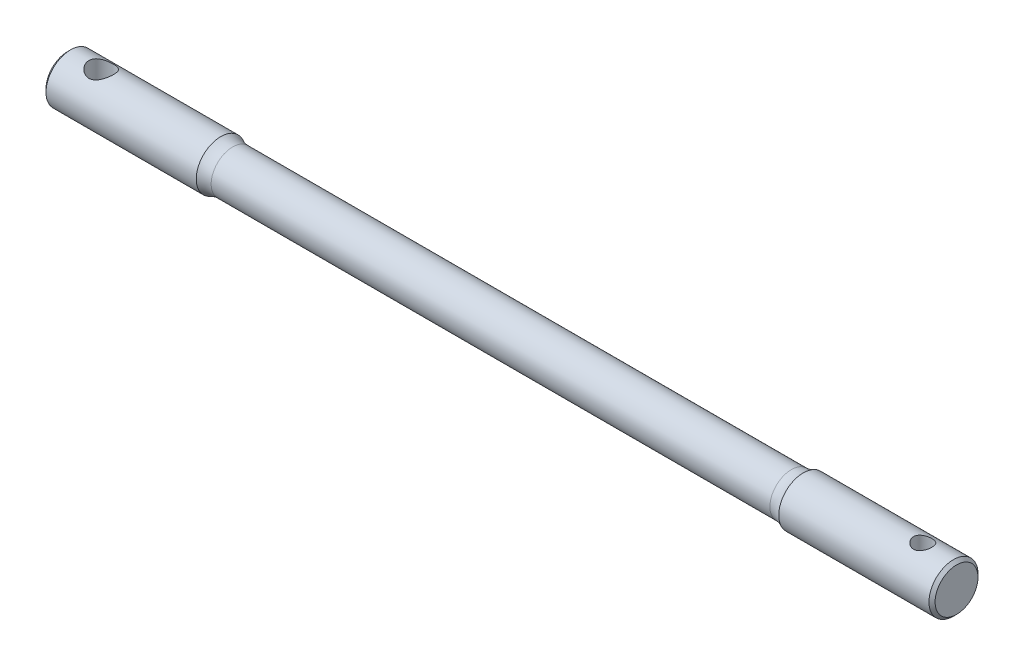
ISO-10303-21;
HEADER;
FILE_DESCRIPTION(('STEP AP214'),'2;1');
FILE_NAME('part.step','',(''),(''),'','','');
FILE_SCHEMA(('AUTOMOTIVE_DESIGN { 1 0 10303 214 1 1 1 1 }'));
ENDSEC;
DATA;
#1=APPLICATION_CONTEXT('core data for automotive mechanical design processes');
#2=APPLICATION_PROTOCOL_DEFINITION('international standard','automotive_design',2000,#1);
#3=PRODUCT_CONTEXT('',#1,'mechanical');
#4=PRODUCT('Part','Part','',(#3));
#5=PRODUCT_RELATED_PRODUCT_CATEGORY('part','',(#4));
#6=PRODUCT_DEFINITION_FORMATION('','',#4);
#7=PRODUCT_DEFINITION_CONTEXT('part definition',#1,'design');
#8=PRODUCT_DEFINITION('design','',#6,#7);
#9=PRODUCT_DEFINITION_SHAPE('','',#8);
#10=(LENGTH_UNIT() NAMED_UNIT(*) SI_UNIT(.MILLI.,.METRE.));
#11=(NAMED_UNIT(*) PLANE_ANGLE_UNIT() SI_UNIT($,.RADIAN.));
#12=(NAMED_UNIT(*) SI_UNIT($,.STERADIAN.) SOLID_ANGLE_UNIT());
#13=UNCERTAINTY_MEASURE_WITH_UNIT(LENGTH_MEASURE(1.E-05),#10,'distance_accuracy_value','');
#14=(GEOMETRIC_REPRESENTATION_CONTEXT(3) GLOBAL_UNCERTAINTY_ASSIGNED_CONTEXT((#13)) GLOBAL_UNIT_ASSIGNED_CONTEXT((#10,
#11,#12)) REPRESENTATION_CONTEXT('',''));
#15=CARTESIAN_POINT('',(0.,0.,0.));
#16=DIRECTION('',(0.,0.,1.));
#17=DIRECTION('',(1.,0.,0.));
#18=AXIS2_PLACEMENT_3D('',#15,#16,#17);
#19=CARTESIAN_POINT('',(0.,0.,0.));
#20=DIRECTION('',(1.,0.,0.));
#21=DIRECTION('',(0.,0.,-1.));
#22=AXIS2_PLACEMENT_3D('',#19,#20,#21);
#23=PLANE('',#22);
#24=CARTESIAN_POINT('',(0.,0.,0.));
#25=DIRECTION('',(1.,0.,0.));
#26=DIRECTION('',(0.,0.,-1.));
#27=AXIS2_PLACEMENT_3D('',#24,#25,#26);
#28=CIRCLE('',#27,3.49999999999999);
#29=CARTESIAN_POINT('',(0.,0.,-3.49999999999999));
#30=VERTEX_POINT('',#29);
#31=EDGE_CURVE('E35',#30,#30,#28,.T.);
#32=ORIENTED_EDGE('',*,*,#31,.T.);
#33=EDGE_LOOP('',(#32));
#34=FACE_BOUND('',#33,.T.);
#35=ADVANCED_FACE('F29',(#34),#23,.T.);
#36=CARTESIAN_POINT('',(36.,0.,0.));
#37=DIRECTION('',(1.,0.,0.));
#38=DIRECTION('',(0.,0.,-1.));
#39=AXIS2_PLACEMENT_3D('',#36,#37,#38);
#40=CYLINDRICAL_SURFACE('',#39,4.);
#41=CARTESIAN_POINT('',(-0.5,0.,0.));
#42=DIRECTION('',(1.,0.,0.));
#43=DIRECTION('',(0.,0.,-1.));
#44=AXIS2_PLACEMENT_3D('',#41,#42,#43);
#45=CIRCLE('',#44,4.);
#46=CARTESIAN_POINT('',(-0.5,0.,-4.));
#47=VERTEX_POINT('',#46);
#48=EDGE_CURVE('E10',#47,#47,#45,.F.);
#49=ORIENTED_EDGE('',*,*,#48,.T.);
#50=EDGE_LOOP('',(#49));
#51=FACE_BOUND('',#50,.T.);
#52=CARTESIAN_POINT('',(-5.5,3.70809924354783,1.5));
#53=CARTESIAN_POINT('',(-5.41899251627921,3.70809640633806,1.50000304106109));
#54=CARTESIAN_POINT('',(-5.33800507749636,3.71078260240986,1.49341597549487));
#55=CARTESIAN_POINT('',(-5.1784719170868,3.72116159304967,1.46736187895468));
#56=CARTESIAN_POINT('',(-5.09992612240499,3.72885423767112,1.44789523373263));
#57=CARTESIAN_POINT('',(-4.94762462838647,3.748254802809,1.39689657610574));
#58=CARTESIAN_POINT('',(-4.87385794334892,3.7599530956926,1.36539347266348));
#59=CARTESIAN_POINT('',(-4.73262810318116,3.78603134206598,1.29131856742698));
#60=CARTESIAN_POINT('',(-4.66516684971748,3.80041210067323,1.24874344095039));
#61=CARTESIAN_POINT('',(-4.53510968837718,3.83103574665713,1.15146661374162));
#62=CARTESIAN_POINT('',(-4.47287147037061,3.84733341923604,1.09630381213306));
#63=CARTESIAN_POINT('',(-4.35827718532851,3.87949750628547,0.976395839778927));
#64=CARTESIAN_POINT('',(-4.30592322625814,3.89536382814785,0.91164863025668));
#65=CARTESIAN_POINT('',(-4.21086048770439,3.92552873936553,0.771694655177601));
#66=CARTESIAN_POINT('',(-4.16854052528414,3.93975561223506,0.696206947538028));
#67=CARTESIAN_POINT('',(-4.09734882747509,3.96438007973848,0.538555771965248));
#68=CARTESIAN_POINT('',(-4.06847242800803,3.97477900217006,0.456394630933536));
#69=CARTESIAN_POINT('',(-4.02624210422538,3.9901869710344,0.291489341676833));
#70=CARTESIAN_POINT('',(-4.01227237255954,3.99540915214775,0.208923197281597));
#71=CARTESIAN_POINT('',(-3.99827879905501,4.0006401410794,0.0424643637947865));
#72=CARTESIAN_POINT('',(-3.99825042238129,4.00065064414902,-0.0414278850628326));
#73=CARTESIAN_POINT('',(-4.01178176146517,3.99559265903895,-0.203743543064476));
#74=CARTESIAN_POINT('',(-4.02466929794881,3.99077541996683,-0.2822321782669));
#75=CARTESIAN_POINT('',(-4.06253591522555,3.97693274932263,-0.435839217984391));
#76=CARTESIAN_POINT('',(-4.08751585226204,3.96790701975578,-0.510957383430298));
#77=CARTESIAN_POINT('',(-4.14917045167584,3.94637769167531,-0.656989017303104));
#78=CARTESIAN_POINT('',(-4.18601000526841,3.93382539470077,-0.727825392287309));
#79=CARTESIAN_POINT('',(-4.27019209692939,3.90651310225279,-0.862486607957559));
#80=CARTESIAN_POINT('',(-4.3175380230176,3.8917523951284,-0.926309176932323));
#81=CARTESIAN_POINT('',(-4.42462728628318,3.86052529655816,-1.04909048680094));
#82=CARTESIAN_POINT('',(-4.48493391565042,3.84400963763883,-1.10754614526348));
#83=CARTESIAN_POINT('',(-4.61459299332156,3.81182460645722,-1.21370395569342));
#84=CARTESIAN_POINT('',(-4.68394770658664,3.79615544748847,-1.261403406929));
#85=CARTESIAN_POINT('',(-4.83171946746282,3.76712703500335,-1.34565611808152));
#86=CARTESIAN_POINT('',(-4.91030349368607,3.75382677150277,-1.38193847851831));
#87=CARTESIAN_POINT('',(-5.07309622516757,3.73172438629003,-1.44056464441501));
#88=CARTESIAN_POINT('',(-5.15730177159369,3.72291976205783,-1.46291620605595));
#89=CARTESIAN_POINT('',(-5.32397596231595,3.71139597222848,-1.49190191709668));
#90=CARTESIAN_POINT('',(-5.40628410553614,3.70836785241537,-1.49933521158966));
#91=CARTESIAN_POINT('',(-5.57100935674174,3.70786539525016,-1.50057885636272));
#92=CARTESIAN_POINT('',(-5.65342643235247,3.71038967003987,-1.49439261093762));
#93=CARTESIAN_POINT('',(-5.81192992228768,3.72039381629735,-1.46929733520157));
#94=CARTESIAN_POINT('',(-5.88813113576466,3.72763276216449,-1.45100618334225));
#95=CARTESIAN_POINT('',(-6.03634794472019,3.74596487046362,-1.40299774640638));
#96=CARTESIAN_POINT('',(-6.10836267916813,3.75705882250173,-1.37327812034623));
#97=CARTESIAN_POINT('',(-6.24916443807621,3.7823624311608,-1.30200292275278));
#98=CARTESIAN_POINT('',(-6.31772929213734,3.79667328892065,-1.26004545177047));
#99=CARTESIAN_POINT('',(-6.44712898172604,3.82662814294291,-1.16591317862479));
#100=CARTESIAN_POINT('',(-6.50796097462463,3.84227262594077,-1.11373463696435));
#101=CARTESIAN_POINT('',(-6.6241683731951,3.87433046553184,-0.996727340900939));
#102=CARTESIAN_POINT('',(-6.67895340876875,3.89072969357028,-0.931306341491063));
#103=CARTESIAN_POINT('',(-6.77683836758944,3.92149874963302,-0.791797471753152));
#104=CARTESIAN_POINT('',(-6.81993825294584,3.93586857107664,-0.717709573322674));
#105=CARTESIAN_POINT('',(-6.89294605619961,3.96094985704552,-0.563016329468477));
#106=CARTESIAN_POINT('',(-6.9228991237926,3.9716738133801,-0.482434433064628));
#107=CARTESIAN_POINT('',(-6.96865641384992,3.98829436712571,-0.316881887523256));
#108=CARTESIAN_POINT('',(-6.9844672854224,3.99419323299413,-0.231913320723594));
#109=CARTESIAN_POINT('',(-7.00077440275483,4.00028407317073,-0.0653355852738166));
#110=CARTESIAN_POINT('',(-7.00210948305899,4.00078860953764,0.0161807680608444));
#111=CARTESIAN_POINT('',(-6.99158484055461,3.99684889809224,0.178226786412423));
#112=CARTESIAN_POINT('',(-6.97972670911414,3.9924052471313,0.258756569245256));
#113=CARTESIAN_POINT('',(-6.94374114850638,3.97921089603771,0.414548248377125));
#114=CARTESIAN_POINT('',(-6.91992009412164,3.97056791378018,0.489890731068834));
#115=CARTESIAN_POINT('',(-6.86098998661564,3.9498778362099,0.635515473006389));
#116=CARTESIAN_POINT('',(-6.82587879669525,3.93783009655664,0.705796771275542));
#117=CARTESIAN_POINT('',(-6.74368605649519,3.91090618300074,0.842540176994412));
#118=CARTESIAN_POINT('',(-6.69616335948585,3.89593240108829,0.908717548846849));
#119=CARTESIAN_POINT('',(-6.5911921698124,3.86499507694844,1.03241734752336));
#120=CARTESIAN_POINT('',(-6.53374013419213,3.84903118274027,1.0899366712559));
#121=CARTESIAN_POINT('',(-6.40693586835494,3.81688129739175,1.19781214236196));
#122=CARTESIAN_POINT('',(-6.33711559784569,3.8007280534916,1.24762999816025));
#123=CARTESIAN_POINT('',(-6.18958413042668,3.77098325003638,1.33484709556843));
#124=CARTESIAN_POINT('',(-6.11187211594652,3.75739195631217,1.37224504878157));
#125=CARTESIAN_POINT('',(-5.9470443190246,3.73402269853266,1.4346588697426));
#126=CARTESIAN_POINT('',(-5.85966563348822,3.7244380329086,1.45906002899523));
#127=CARTESIAN_POINT('',(-5.68151472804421,3.71147994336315,1.49172356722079));
#128=CARTESIAN_POINT('',(-5.59074478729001,3.70810242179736,1.49999659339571));
#129=CARTESIAN_POINT('',(-5.5,3.70809924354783,1.5));
#130=B_SPLINE_CURVE_WITH_KNOTS('',3,(#52,#53,#54,#55,#56,#57,#58,#59,#60,#61,#62,#63,#64,#65,
#66,#67,#68,#69,#70,#71,#72,#73,#74,#75,#76,#77,#78,#79,#80,#81,#82,#83,#84,#85,#86,#87,#88,#89,
#90,#91,#92,#93,#94,#95,#96,#97,#98,#99,#100,#101,#102,#103,#104,#105,#106,#107,#108,#109,#110,
#111,#112,#113,#114,#115,#116,#117,#118,#119,#120,#121,#122,#123,#124,#125,#126,#127,#128,#129),
.UNSPECIFIED.,.T.,.F.,(4,2,2,2,2,2,2,2,2,2,2,2,2,2,2,2,2,2,2,2,2,2,2,2,2,2,2,2,2,2,2,2,2,2,2,2,
2,2,4),(0.,0.242684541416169,0.485361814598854,0.727459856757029,0.969630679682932,
1.22274652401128,1.47591628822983,1.73770072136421,1.9993942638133,2.24980018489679,
2.50012465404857,2.73806472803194,2.97602165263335,3.21744131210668,3.45893893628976,
3.71456675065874,3.97025867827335,4.23162592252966,4.49284751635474,4.73965657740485,
4.98640395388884,5.22143845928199,5.45652113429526,5.70041561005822,5.94439948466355,
6.20385016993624,6.46330169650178,6.72185508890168,6.98028685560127,7.22365720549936,
7.4669982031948,7.70440274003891,7.94185223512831,8.18928323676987,8.43680270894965,
8.69738599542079,8.95799630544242,9.23003178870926,9.50188762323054),.UNSPECIFIED.);
#131=CARTESIAN_POINT('',(-5.5,3.70809924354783,1.5));
#132=VERTEX_POINT('',#131);
#133=EDGE_CURVE('E56',#132,#132,#130,.T.);
#134=ORIENTED_EDGE('',*,*,#133,.F.);
#135=EDGE_LOOP('',(#134));
#136=FACE_BOUND('',#135,.T.);
#137=CARTESIAN_POINT('',(-5.5,-3.70809924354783,1.5));
#138=CARTESIAN_POINT('',(-5.58100748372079,-3.70809640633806,1.50000304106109));
#139=CARTESIAN_POINT('',(-5.66199492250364,-3.71078260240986,1.49341597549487));
#140=CARTESIAN_POINT('',(-5.8215280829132,-3.72116159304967,1.46736187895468));
#141=CARTESIAN_POINT('',(-5.90007387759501,-3.72885423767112,1.44789523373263));
#142=CARTESIAN_POINT('',(-6.05237537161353,-3.748254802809,1.39689657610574));
#143=CARTESIAN_POINT('',(-6.12614205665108,-3.7599530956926,1.36539347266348));
#144=CARTESIAN_POINT('',(-6.26737189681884,-3.78603134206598,1.29131856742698));
#145=CARTESIAN_POINT('',(-6.33483315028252,-3.80041210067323,1.24874344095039));
#146=CARTESIAN_POINT('',(-6.46489031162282,-3.83103574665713,1.15146661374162));
#147=CARTESIAN_POINT('',(-6.52712852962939,-3.84733341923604,1.09630381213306));
#148=CARTESIAN_POINT('',(-6.64172281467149,-3.87949750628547,0.976395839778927));
#149=CARTESIAN_POINT('',(-6.69407677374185,-3.89536382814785,0.91164863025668));
#150=CARTESIAN_POINT('',(-6.78913951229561,-3.92552873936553,0.771694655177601));
#151=CARTESIAN_POINT('',(-6.83145947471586,-3.93975561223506,0.696206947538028));
#152=CARTESIAN_POINT('',(-6.90265117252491,-3.96438007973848,0.538555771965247));
#153=CARTESIAN_POINT('',(-6.93152757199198,-3.97477900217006,0.456394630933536));
#154=CARTESIAN_POINT('',(-6.97375789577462,-3.9901869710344,0.291489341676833));
#155=CARTESIAN_POINT('',(-6.98772762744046,-3.99540915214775,0.208923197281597));
#156=CARTESIAN_POINT('',(-7.00172120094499,-4.0006401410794,0.0424643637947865));
#157=CARTESIAN_POINT('',(-7.00174957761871,-4.00065064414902,-0.0414278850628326));
#158=CARTESIAN_POINT('',(-6.98821823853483,-3.99559265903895,-0.203743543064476));
#159=CARTESIAN_POINT('',(-6.97533070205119,-3.99077541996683,-0.2822321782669));
#160=CARTESIAN_POINT('',(-6.93746408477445,-3.97693274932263,-0.435839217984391));
#161=CARTESIAN_POINT('',(-6.91248414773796,-3.96790701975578,-0.510957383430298));
#162=CARTESIAN_POINT('',(-6.85082954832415,-3.94637769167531,-0.656989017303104));
#163=CARTESIAN_POINT('',(-6.81398999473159,-3.93382539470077,-0.727825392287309));
#164=CARTESIAN_POINT('',(-6.72980790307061,-3.90651310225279,-0.862486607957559));
#165=CARTESIAN_POINT('',(-6.6824619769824,-3.8917523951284,-0.926309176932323));
#166=CARTESIAN_POINT('',(-6.57537271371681,-3.86052529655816,-1.04909048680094));
#167=CARTESIAN_POINT('',(-6.51506608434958,-3.84400963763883,-1.10754614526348));
#168=CARTESIAN_POINT('',(-6.38540700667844,-3.81182460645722,-1.21370395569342));
#169=CARTESIAN_POINT('',(-6.31605229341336,-3.79615544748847,-1.261403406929));
#170=CARTESIAN_POINT('',(-6.16828053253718,-3.76712703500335,-1.34565611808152));
#171=CARTESIAN_POINT('',(-6.08969650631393,-3.75382677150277,-1.38193847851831));
#172=CARTESIAN_POINT('',(-5.92690377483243,-3.73172438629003,-1.44056464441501));
#173=CARTESIAN_POINT('',(-5.84269822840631,-3.72291976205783,-1.46291620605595));
#174=CARTESIAN_POINT('',(-5.67602403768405,-3.71139597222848,-1.49190191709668));
#175=CARTESIAN_POINT('',(-5.59371589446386,-3.70836785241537,-1.49933521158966));
#176=CARTESIAN_POINT('',(-5.42899064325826,-3.70786539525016,-1.50057885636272));
#177=CARTESIAN_POINT('',(-5.34657356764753,-3.71038967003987,-1.49439261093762));
#178=CARTESIAN_POINT('',(-5.18807007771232,-3.72039381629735,-1.46929733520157));
#179=CARTESIAN_POINT('',(-5.11186886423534,-3.72763276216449,-1.45100618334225));
#180=CARTESIAN_POINT('',(-4.96365205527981,-3.74596487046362,-1.40299774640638));
#181=CARTESIAN_POINT('',(-4.89163732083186,-3.75705882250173,-1.37327812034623));
#182=CARTESIAN_POINT('',(-4.75083556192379,-3.7823624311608,-1.30200292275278));
#183=CARTESIAN_POINT('',(-4.68227070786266,-3.79667328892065,-1.26004545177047));
#184=CARTESIAN_POINT('',(-4.55287101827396,-3.82662814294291,-1.16591317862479));
#185=CARTESIAN_POINT('',(-4.49203902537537,-3.84227262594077,-1.11373463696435));
#186=CARTESIAN_POINT('',(-4.3758316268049,-3.87433046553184,-0.996727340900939));
#187=CARTESIAN_POINT('',(-4.32104659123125,-3.89072969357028,-0.931306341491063));
#188=CARTESIAN_POINT('',(-4.22316163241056,-3.92149874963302,-0.791797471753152));
#189=CARTESIAN_POINT('',(-4.18006174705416,-3.93586857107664,-0.717709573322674));
#190=CARTESIAN_POINT('',(-4.10705394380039,-3.96094985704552,-0.563016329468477));
#191=CARTESIAN_POINT('',(-4.0771008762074,-3.9716738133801,-0.482434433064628));
#192=CARTESIAN_POINT('',(-4.03134358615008,-3.98829436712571,-0.316881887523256));
#193=CARTESIAN_POINT('',(-4.0155327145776,-3.99419323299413,-0.231913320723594));
#194=CARTESIAN_POINT('',(-3.99922559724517,-4.00028407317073,-0.0653355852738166));
#195=CARTESIAN_POINT('',(-3.99789051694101,-4.00078860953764,0.0161807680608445));
#196=CARTESIAN_POINT('',(-4.00841515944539,-3.99684889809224,0.178226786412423));
#197=CARTESIAN_POINT('',(-4.02027329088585,-3.9924052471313,0.258756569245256));
#198=CARTESIAN_POINT('',(-4.05625885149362,-3.97921089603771,0.414548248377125));
#199=CARTESIAN_POINT('',(-4.08007990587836,-3.97056791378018,0.489890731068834));
#200=CARTESIAN_POINT('',(-4.13901001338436,-3.9498778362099,0.635515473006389));
#201=CARTESIAN_POINT('',(-4.17412120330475,-3.93783009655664,0.705796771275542));
#202=CARTESIAN_POINT('',(-4.25631394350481,-3.91090618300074,0.842540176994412));
#203=CARTESIAN_POINT('',(-4.30383664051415,-3.89593240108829,0.908717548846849));
#204=CARTESIAN_POINT('',(-4.4088078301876,-3.86499507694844,1.03241734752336));
#205=CARTESIAN_POINT('',(-4.46625986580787,-3.84903118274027,1.0899366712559));
#206=CARTESIAN_POINT('',(-4.59306413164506,-3.81688129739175,1.19781214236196));
#207=CARTESIAN_POINT('',(-4.66288440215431,-3.8007280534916,1.24762999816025));
#208=CARTESIAN_POINT('',(-4.81041586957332,-3.77098325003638,1.33484709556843));
#209=CARTESIAN_POINT('',(-4.88812788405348,-3.75739195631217,1.37224504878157));
#210=CARTESIAN_POINT('',(-5.0529556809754,-3.73402269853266,1.4346588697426));
#211=CARTESIAN_POINT('',(-5.14033436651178,-3.7244380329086,1.45906002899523));
#212=CARTESIAN_POINT('',(-5.31848527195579,-3.71147994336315,1.49172356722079));
#213=CARTESIAN_POINT('',(-5.40925521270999,-3.70810242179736,1.49999659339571));
#214=CARTESIAN_POINT('',(-5.5,-3.70809924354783,1.5));
#215=B_SPLINE_CURVE_WITH_KNOTS('',3,(#137,#138,#139,#140,#141,#142,#143,#144,#145,#146,#147,
#148,#149,#150,#151,#152,#153,#154,#155,#156,#157,#158,#159,#160,#161,#162,#163,#164,#165,#166,
#167,#168,#169,#170,#171,#172,#173,#174,#175,#176,#177,#178,#179,#180,#181,#182,#183,#184,#185,
#186,#187,#188,#189,#190,#191,#192,#193,#194,#195,#196,#197,#198,#199,#200,#201,#202,#203,#204,
#205,#206,#207,#208,#209,#210,#211,#212,#213,#214),.UNSPECIFIED.,.T.,.F.,(4,2,2,2,2,2,2,2,2,2,2,
2,2,2,2,2,2,2,2,2,2,2,2,2,2,2,2,2,2,2,2,2,2,2,2,2,2,2,4),(0.,0.242684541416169,
0.485361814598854,0.727459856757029,0.969630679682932,1.22274652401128,1.47591628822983,
1.73770072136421,1.9993942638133,2.24980018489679,2.50012465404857,2.73806472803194,
2.97602165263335,3.21744131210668,3.45893893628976,3.71456675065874,3.97025867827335,
4.23162592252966,4.49284751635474,4.73965657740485,4.98640395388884,5.22143845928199,
5.45652113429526,5.70041561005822,5.94439948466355,6.20385016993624,6.46330169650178,
6.72185508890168,6.98028685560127,7.22365720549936,7.4669982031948,7.70440274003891,
7.94185223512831,8.18928323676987,8.43680270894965,8.69738599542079,8.95799630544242,
9.23003178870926,9.50188762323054),.UNSPECIFIED.);
#216=CARTESIAN_POINT('',(-5.5,-3.70809924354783,1.5));
#217=VERTEX_POINT('',#216);
#218=EDGE_CURVE('E80',#217,#217,#215,.T.);
#219=ORIENTED_EDGE('',*,*,#218,.F.);
#220=EDGE_LOOP('',(#219));
#221=FACE_BOUND('',#220,.T.);
#222=CARTESIAN_POINT('',(-25.,0.,0.));
#223=DIRECTION('',(1.,0.,0.));
#224=DIRECTION('',(0.,0.,-1.));
#225=AXIS2_PLACEMENT_3D('',#222,#223,#224);
#226=CIRCLE('',#225,4.);
#227=CARTESIAN_POINT('',(-25.,0.,-4.));
#228=VERTEX_POINT('',#227);
#229=EDGE_CURVE('E194',#228,#228,#226,.T.);
#230=ORIENTED_EDGE('',*,*,#229,.T.);
#231=EDGE_LOOP('',(#230));
#232=FACE_BOUND('',#231,.T.);
#233=ADVANCED_FACE('F88',(#51,#136,#221,#232),#40,.T.);
#234=CARTESIAN_POINT('',(-26.9364916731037,0.,0.));
#235=DIRECTION('',(1.,0.,0.));
#236=DIRECTION('',(0.,0.,-1.));
#237=AXIS2_PLACEMENT_3D('',#234,#235,#236);
#238=TOROIDAL_SURFACE('',#237,7.5,4.);
#239=ORIENTED_EDGE('',*,*,#229,.F.);
#240=EDGE_LOOP('',(#239));
#241=FACE_BOUND('',#240,.T.);
#242=CARTESIAN_POINT('',(-26.9364916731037,0.,0.));
#243=DIRECTION('',(1.,0.,0.));
#244=DIRECTION('',(0.,0.,-1.));
#245=AXIS2_PLACEMENT_3D('',#242,#243,#244);
#246=CIRCLE('',#245,3.5);
#247=CARTESIAN_POINT('',(-26.9364916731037,0.,-3.5));
#248=VERTEX_POINT('',#247);
#249=EDGE_CURVE('E190',#248,#248,#246,.T.);
#250=ORIENTED_EDGE('',*,*,#249,.T.);
#251=EDGE_LOOP('',(#250));
#252=FACE_BOUND('',#251,.T.);
#253=ADVANCED_FACE('F92',(#241,#252),#238,.F.);
#254=CARTESIAN_POINT('',(36.,0.,0.));
#255=DIRECTION('',(1.,0.,0.));
#256=DIRECTION('',(0.,0.,-1.));
#257=AXIS2_PLACEMENT_3D('',#254,#255,#256);
#258=CYLINDRICAL_SURFACE('',#257,3.50000000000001);
#259=CARTESIAN_POINT('',(-118.063508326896,0.,0.));
#260=DIRECTION('',(1.,0.,0.));
#261=DIRECTION('',(0.,0.,-1.));
#262=AXIS2_PLACEMENT_3D('',#259,#260,#261);
#263=CIRCLE('',#262,3.50000000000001);
#264=CARTESIAN_POINT('',(-118.063508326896,0.,-3.50000000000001));
#265=VERTEX_POINT('',#264);
#266=EDGE_CURVE('E187',#265,#265,#263,.T.);
#267=ORIENTED_EDGE('',*,*,#266,.T.);
#268=EDGE_LOOP('',(#267));
#269=FACE_BOUND('',#268,.T.);
#270=ORIENTED_EDGE('',*,*,#249,.F.);
#271=EDGE_LOOP('',(#270));
#272=FACE_BOUND('',#271,.T.);
#273=ADVANCED_FACE('F96',(#269,#272),#258,.T.);
#274=CARTESIAN_POINT('',(-118.063508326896,0.,0.));
#275=DIRECTION('',(1.,0.,0.));
#276=DIRECTION('',(0.,0.,-1.));
#277=AXIS2_PLACEMENT_3D('',#274,#275,#276);
#278=TOROIDAL_SURFACE('',#277,7.50000000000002,4.);
#279=ORIENTED_EDGE('',*,*,#266,.F.);
#280=EDGE_LOOP('',(#279));
#281=FACE_BOUND('',#280,.T.);
#282=CARTESIAN_POINT('',(-120.,0.,0.));
#283=DIRECTION('',(1.,0.,0.));
#284=DIRECTION('',(0.,0.,-1.));
#285=AXIS2_PLACEMENT_3D('',#282,#283,#284);
#286=CIRCLE('',#285,4.00000000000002);
#287=CARTESIAN_POINT('',(-120.,0.,-4.00000000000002));
#288=VERTEX_POINT('',#287);
#289=EDGE_CURVE('E87',#288,#288,#286,.T.);
#290=ORIENTED_EDGE('',*,*,#289,.T.);
#291=EDGE_LOOP('',(#290));
#292=FACE_BOUND('',#291,.T.);
#293=ADVANCED_FACE('F99',(#281,#292),#278,.F.);
#294=CARTESIAN_POINT('',(36.,0.,0.));
#295=DIRECTION('',(1.,0.,0.));
#296=DIRECTION('',(0.,0.,-1.));
#297=AXIS2_PLACEMENT_3D('',#294,#295,#296);
#298=CYLINDRICAL_SURFACE('',#297,4.00000000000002);
#299=CARTESIAN_POINT('',(-144.5,0.,0.));
#300=DIRECTION('',(-1.,0.,0.));
#301=DIRECTION('',(0.,0.,1.));
#302=AXIS2_PLACEMENT_3D('',#299,#300,#301);
#303=CIRCLE('',#302,4.00000000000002);
#304=CARTESIAN_POINT('',(-144.5,0.,4.00000000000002));
#305=VERTEX_POINT('',#304);
#306=EDGE_CURVE('E43',#305,#305,#303,.F.);
#307=ORIENTED_EDGE('',*,*,#306,.T.);
#308=EDGE_LOOP('',(#307));
#309=FACE_BOUND('',#308,.T.);
#310=CARTESIAN_POINT('',(-139.5,3.46410161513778,2.));
#311=CARTESIAN_POINT('',(-139.395786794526,3.4641118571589,1.99999158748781));
#312=CARTESIAN_POINT('',(-139.291437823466,3.4688763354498,1.99179963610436));
#313=CARTESIAN_POINT('',(-139.085944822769,3.48724701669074,1.95944672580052));
#314=CARTESIAN_POINT('',(-138.984807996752,3.50087179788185,1.93525221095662));
#315=CARTESIAN_POINT('',(-138.789096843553,3.53498701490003,1.8721998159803));
#316=CARTESIAN_POINT('',(-138.694490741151,3.5554408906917,1.83341988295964));
#317=CARTESIAN_POINT('',(-138.513151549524,3.60085327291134,1.74253507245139));
#318=CARTESIAN_POINT('',(-138.426418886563,3.62581202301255,1.69042947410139));
#319=CARTESIAN_POINT('',(-138.255388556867,3.67993738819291,1.56933307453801));
#320=CARTESIAN_POINT('',(-138.171881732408,3.70928127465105,1.49930407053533));
#321=CARTESIAN_POINT('',(-138.017183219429,3.76743965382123,1.34650761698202));
#322=CARTESIAN_POINT('',(-137.945997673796,3.7962538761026,1.26373385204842));
#323=CARTESIAN_POINT('',(-137.813265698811,3.85242953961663,1.08097912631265));
#324=CARTESIAN_POINT('',(-137.752692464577,3.87956212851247,0.980214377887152));
#325=CARTESIAN_POINT('',(-137.649718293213,3.92701512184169,0.768314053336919));
#326=CARTESIAN_POINT('',(-137.607305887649,3.94733982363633,0.657185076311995));
#327=CARTESIAN_POINT('',(-137.544990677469,3.97760922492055,0.436089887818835));
#328=CARTESIAN_POINT('',(-137.523700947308,3.98818960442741,0.326603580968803));
#329=CARTESIAN_POINT('',(-137.499667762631,4.00015167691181,0.105141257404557));
#330=CARTESIAN_POINT('',(-137.496913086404,4.00153893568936,-0.00683321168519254));
#331=CARTESIAN_POINT('',(-137.509493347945,3.99525963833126,-0.219665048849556));
#332=CARTESIAN_POINT('',(-137.523276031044,3.98836991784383,-0.32064239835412));
#333=CARTESIAN_POINT('',(-137.565761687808,3.96748490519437,-0.51862754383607));
#334=CARTESIAN_POINT('',(-137.594465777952,3.95348908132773,-0.615635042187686));
#335=CARTESIAN_POINT('',(-137.66616513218,3.91943166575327,-0.804618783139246));
#336=CARTESIAN_POINT('',(-137.709352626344,3.89928883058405,-0.896506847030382));
#337=CARTESIAN_POINT('',(-137.808526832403,3.85475291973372,-1.0719536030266));
#338=CARTESIAN_POINT('',(-137.864518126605,3.83035832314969,-1.15550929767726));
#339=CARTESIAN_POINT('',(-137.993790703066,3.77688788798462,-1.32034732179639));
#340=CARTESIAN_POINT('',(-138.068206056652,3.74758751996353,-1.40066815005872));
#341=CARTESIAN_POINT('',(-138.22917944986,3.68908681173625,-1.54820874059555));
#342=CARTESIAN_POINT('',(-138.315746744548,3.6598865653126,-1.61541842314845));
#343=CARTESIAN_POINT('',(-138.505296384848,3.60288312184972,-1.73901066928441));
#344=CARTESIAN_POINT('',(-138.608972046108,3.57528639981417,-1.7944346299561));
#345=CARTESIAN_POINT('',(-138.825875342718,3.52750900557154,-1.88663822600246));
#346=CARTESIAN_POINT('',(-138.939092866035,3.50732060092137,-1.92343731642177));
#347=CARTESIAN_POINT('',(-139.162429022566,3.47889271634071,-1.97436042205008));
#348=CARTESIAN_POINT('',(-139.272082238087,3.46983311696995,-1.99005024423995));
#349=CARTESIAN_POINT('',(-139.492802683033,3.46235838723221,-2.00303389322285));
#350=CARTESIAN_POINT('',(-139.60386885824,3.46393573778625,-2.00034071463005));
#351=CARTESIAN_POINT('',(-139.811307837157,3.47668673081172,-1.97807208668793));
#352=CARTESIAN_POINT('',(-139.907958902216,3.4867917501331,-1.96037563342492));
#353=CARTESIAN_POINT('',(-140.096735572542,3.51388043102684,-1.91139256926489));
#354=CARTESIAN_POINT('',(-140.188859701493,3.5308663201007,-1.88010155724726));
#355=CARTESIAN_POINT('',(-140.370822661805,3.57072444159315,-1.80329517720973));
#356=CARTESIAN_POINT('',(-140.460358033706,3.59383286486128,-1.7571881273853));
#357=CARTESIAN_POINT('',(-140.630938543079,3.64312238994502,-1.65257412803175));
#358=CARTESIAN_POINT('',(-140.71197928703,3.669305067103,-1.59406080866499));
#359=CARTESIAN_POINT('',(-140.873957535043,3.72575996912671,-1.45767433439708));
#360=CARTESIAN_POINT('',(-140.953594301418,3.75613166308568,-1.37829054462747));
#361=CARTESIAN_POINT('',(-141.098824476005,3.81468469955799,-1.20680899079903));
#362=CARTESIAN_POINT('',(-141.164413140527,3.84286530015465,-1.11470694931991));
#363=CARTESIAN_POINT('',(-141.281147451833,3.89482723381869,-0.917070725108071));
#364=CARTESIAN_POINT('',(-141.331866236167,3.91847283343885,-0.811246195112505));
#365=CARTESIAN_POINT('',(-141.41427580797,3.95766709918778,-0.591044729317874));
#366=CARTESIAN_POINT('',(-141.445983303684,3.97322287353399,-0.47667540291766));
#367=CARTESIAN_POINT('',(-141.486737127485,3.99335016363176,-0.253959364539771));
#368=CARTESIAN_POINT('',(-141.497595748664,3.99879855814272,-0.146022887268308));
#369=CARTESIAN_POINT('',(-141.501686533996,4.00084260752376,0.0702519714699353));
#370=CARTESIAN_POINT('',(-141.494924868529,3.99744136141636,0.178590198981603));
#371=CARTESIAN_POINT('',(-141.465167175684,3.98267937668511,0.385075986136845));
#372=CARTESIAN_POINT('',(-141.443270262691,3.97185789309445,0.483424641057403));
#373=CARTESIAN_POINT('',(-141.385346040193,3.94384187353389,0.67489189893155));
#374=CARTESIAN_POINT('',(-141.349316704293,3.92664642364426,0.768009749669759));
#375=CARTESIAN_POINT('',(-141.262545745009,3.88651861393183,0.950846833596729));
#376=CARTESIAN_POINT('',(-141.211240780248,3.86337234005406,1.04025036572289));
#377=CARTESIAN_POINT('',(-141.096084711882,3.81376266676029,1.20954920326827));
#378=CARTESIAN_POINT('',(-141.032227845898,3.78729774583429,1.28944011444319));
#379=CARTESIAN_POINT('',(-140.886403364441,3.73057218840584,1.44582833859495));
#380=CARTESIAN_POINT('',(-140.8032658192,3.70019591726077,1.52119665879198));
#381=CARTESIAN_POINT('',(-140.625107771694,3.64126158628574,1.65732528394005));
#382=CARTESIAN_POINT('',(-140.530076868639,3.61270515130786,1.71807266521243));
#383=CARTESIAN_POINT('',(-140.32669110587,3.55999186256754,1.8248671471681));
#384=CARTESIAN_POINT('',(-140.218010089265,3.53600256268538,1.87038902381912));
#385=CARTESIAN_POINT('',(-140.049421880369,3.50696218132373,1.92395929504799));
#386=CARTESIAN_POINT('',(-139.992352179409,3.49844389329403,1.93935666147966));
#387=CARTESIAN_POINT('',(-139.8767674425,3.48406059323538,1.96508069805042));
#388=CARTESIAN_POINT('',(-139.818253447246,3.47819372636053,1.97541091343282));
#389=CARTESIAN_POINT('',(-139.716399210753,3.4705902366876,1.9887293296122));
#390=CARTESIAN_POINT('',(-139.67326694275,3.46816389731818,1.99295091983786));
#391=CARTESIAN_POINT('',(-139.586764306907,3.46491740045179,1.99858810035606));
#392=CARTESIAN_POINT('',(-139.543393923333,3.46409735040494,2.00000350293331));
#393=CARTESIAN_POINT('',(-139.5,3.46410161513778,2.));
#394=B_SPLINE_CURVE_WITH_KNOTS('',3,(#310,#311,#312,#313,#314,#315,#316,#317,#318,#319,#320,
#321,#322,#323,#324,#325,#326,#327,#328,#329,#330,#331,#332,#333,#334,#335,#336,#337,#338,#339,
#340,#341,#342,#343,#344,#345,#346,#347,#348,#349,#350,#351,#352,#353,#354,#355,#356,#357,#358,
#359,#360,#361,#362,#363,#364,#365,#366,#367,#368,#369,#370,#371,#372,#373,#374,#375,#376,#377,
#378,#379,#380,#381,#382,#383,#384,#385,#386,#387,#388,#389,#390,#391,#392,#393),.UNSPECIFIED.,
.T.,.F.,(4,2,2,2,2,2,2,2,2,2,2,2,2,2,2,2,2,2,2,2,2,2,2,2,2,2,2,2,2,2,2,2,2,2,2,2,2,2,2,2,2,4),
(0.,0.31246424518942,0.625585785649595,0.937057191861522,1.24854545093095,1.58572462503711,
1.92307142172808,2.28315784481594,2.64301653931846,2.97726969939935,3.31132047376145,
3.61632194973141,3.92134625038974,4.23059069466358,4.53994598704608,4.87854382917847,
5.21740096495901,5.57777683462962,5.93777548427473,6.26924581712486,6.6004818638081,
6.89548366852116,7.19058104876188,7.49934592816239,7.80826972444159,8.15613487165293,
8.50411729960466,8.86128362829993,9.21813559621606,9.54224540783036,9.86624173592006,
10.1688884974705,10.4715786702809,10.7872150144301,11.102996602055,11.450204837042,
11.7977188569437,12.1562149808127,12.3351395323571,12.5139387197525,12.6440387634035,
12.7741475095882),.UNSPECIFIED.);
#395=CARTESIAN_POINT('',(-139.5,3.46410161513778,2.));
#396=VERTEX_POINT('',#395);
#397=EDGE_CURVE('E49',#396,#396,#394,.T.);
#398=ORIENTED_EDGE('',*,*,#397,.F.);
#399=EDGE_LOOP('',(#398));
#400=FACE_BOUND('',#399,.T.);
#401=CARTESIAN_POINT('',(-139.5,-3.46410161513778,2.));
#402=CARTESIAN_POINT('',(-139.604213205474,-3.4641118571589,1.99999158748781));
#403=CARTESIAN_POINT('',(-139.708562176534,-3.4688763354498,1.99179963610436));
#404=CARTESIAN_POINT('',(-139.914055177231,-3.48724701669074,1.95944672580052));
#405=CARTESIAN_POINT('',(-140.015192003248,-3.50087179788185,1.93525221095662));
#406=CARTESIAN_POINT('',(-140.210903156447,-3.53498701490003,1.8721998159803));
#407=CARTESIAN_POINT('',(-140.305509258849,-3.5554408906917,1.83341988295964));
#408=CARTESIAN_POINT('',(-140.486848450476,-3.60085327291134,1.74253507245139));
#409=CARTESIAN_POINT('',(-140.573581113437,-3.62581202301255,1.69042947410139));
#410=CARTESIAN_POINT('',(-140.744611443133,-3.67993738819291,1.569333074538));
#411=CARTESIAN_POINT('',(-140.828118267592,-3.70928127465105,1.49930407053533));
#412=CARTESIAN_POINT('',(-140.982816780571,-3.76743965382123,1.34650761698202));
#413=CARTESIAN_POINT('',(-141.054002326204,-3.7962538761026,1.26373385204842));
#414=CARTESIAN_POINT('',(-141.186734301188,-3.85242953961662,1.08097912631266));
#415=CARTESIAN_POINT('',(-141.247307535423,-3.87956212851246,0.98021437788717));
#416=CARTESIAN_POINT('',(-141.350281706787,-3.92701512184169,0.76831405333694));
#417=CARTESIAN_POINT('',(-141.392694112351,-3.94733982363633,0.657185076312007));
#418=CARTESIAN_POINT('',(-141.455009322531,-3.97760922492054,0.436089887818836));
#419=CARTESIAN_POINT('',(-141.476299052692,-3.98818960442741,0.326603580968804));
#420=CARTESIAN_POINT('',(-141.500332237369,-4.00015167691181,0.105141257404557));
#421=CARTESIAN_POINT('',(-141.503086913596,-4.00153893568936,-0.00683321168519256));
#422=CARTESIAN_POINT('',(-141.490506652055,-3.99525963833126,-0.219665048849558));
#423=CARTESIAN_POINT('',(-141.476723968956,-3.98836991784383,-0.320642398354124));
#424=CARTESIAN_POINT('',(-141.434238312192,-3.96748490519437,-0.518627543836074));
#425=CARTESIAN_POINT('',(-141.405534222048,-3.95348908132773,-0.615635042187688));
#426=CARTESIAN_POINT('',(-141.33383486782,-3.91943166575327,-0.804618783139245));
#427=CARTESIAN_POINT('',(-141.290647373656,-3.89928883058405,-0.896506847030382));
#428=CARTESIAN_POINT('',(-141.191473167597,-3.85475291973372,-1.0719536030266));
#429=CARTESIAN_POINT('',(-141.135481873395,-3.83035832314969,-1.15550929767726));
#430=CARTESIAN_POINT('',(-141.006209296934,-3.77688788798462,-1.32034732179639));
#431=CARTESIAN_POINT('',(-140.931793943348,-3.74758751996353,-1.40066815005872));
#432=CARTESIAN_POINT('',(-140.77082055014,-3.68908681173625,-1.54820874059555));
#433=CARTESIAN_POINT('',(-140.684253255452,-3.6598865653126,-1.61541842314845));
#434=CARTESIAN_POINT('',(-140.494703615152,-3.60288312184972,-1.73901066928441));
#435=CARTESIAN_POINT('',(-140.391027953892,-3.57528639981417,-1.7944346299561));
#436=CARTESIAN_POINT('',(-140.174124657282,-3.52750900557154,-1.88663822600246));
#437=CARTESIAN_POINT('',(-140.060907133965,-3.50732060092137,-1.92343731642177));
#438=CARTESIAN_POINT('',(-139.837570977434,-3.47889271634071,-1.97436042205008));
#439=CARTESIAN_POINT('',(-139.727917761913,-3.46983311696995,-1.99005024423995));
#440=CARTESIAN_POINT('',(-139.507197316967,-3.46235838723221,-2.00303389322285));
#441=CARTESIAN_POINT('',(-139.39613114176,-3.46393573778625,-2.00034071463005));
#442=CARTESIAN_POINT('',(-139.188692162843,-3.47668673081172,-1.97807208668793));
#443=CARTESIAN_POINT('',(-139.092041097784,-3.4867917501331,-1.96037563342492));
#444=CARTESIAN_POINT('',(-138.903264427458,-3.51388043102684,-1.91139256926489));
#445=CARTESIAN_POINT('',(-138.811140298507,-3.5308663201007,-1.88010155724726));
#446=CARTESIAN_POINT('',(-138.629177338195,-3.57072444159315,-1.80329517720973));
#447=CARTESIAN_POINT('',(-138.539641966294,-3.59383286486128,-1.7571881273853));
#448=CARTESIAN_POINT('',(-138.369061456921,-3.64312238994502,-1.65257412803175));
#449=CARTESIAN_POINT('',(-138.288020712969,-3.669305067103,-1.59406080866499));
#450=CARTESIAN_POINT('',(-138.126042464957,-3.7257599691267,-1.4576743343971));
#451=CARTESIAN_POINT('',(-138.046405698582,-3.75613166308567,-1.3782905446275));
#452=CARTESIAN_POINT('',(-137.901175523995,-3.81468469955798,-1.20680899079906));
#453=CARTESIAN_POINT('',(-137.835586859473,-3.84286530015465,-1.11470694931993));
#454=CARTESIAN_POINT('',(-137.718852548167,-3.89482723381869,-0.917070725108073));
#455=CARTESIAN_POINT('',(-137.668133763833,-3.91847283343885,-0.811246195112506));
#456=CARTESIAN_POINT('',(-137.58572419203,-3.95766709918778,-0.591044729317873));
#457=CARTESIAN_POINT('',(-137.554016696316,-3.97322287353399,-0.47667540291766));
#458=CARTESIAN_POINT('',(-137.513262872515,-3.99335016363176,-0.253959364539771));
#459=CARTESIAN_POINT('',(-137.502404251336,-3.99879855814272,-0.146022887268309));
#460=CARTESIAN_POINT('',(-137.498313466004,-4.00084260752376,0.070251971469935));
#461=CARTESIAN_POINT('',(-137.505075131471,-3.99744136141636,0.178590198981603));
#462=CARTESIAN_POINT('',(-137.534832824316,-3.98267937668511,0.385075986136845));
#463=CARTESIAN_POINT('',(-137.556729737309,-3.97185789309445,0.483424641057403));
#464=CARTESIAN_POINT('',(-137.614653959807,-3.94384187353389,0.67489189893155));
#465=CARTESIAN_POINT('',(-137.650683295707,-3.92664642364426,0.768009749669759));
#466=CARTESIAN_POINT('',(-137.737454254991,-3.88651861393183,0.950846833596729));
#467=CARTESIAN_POINT('',(-137.788759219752,-3.86337234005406,1.04025036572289));
#468=CARTESIAN_POINT('',(-137.903915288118,-3.81376266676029,1.20954920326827));
#469=CARTESIAN_POINT('',(-137.967772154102,-3.78729774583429,1.28944011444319));
#470=CARTESIAN_POINT('',(-138.113596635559,-3.73057218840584,1.44582833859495));
#471=CARTESIAN_POINT('',(-138.1967341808,-3.70019591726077,1.52119665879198));
#472=CARTESIAN_POINT('',(-138.374892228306,-3.64126158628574,1.65732528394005));
#473=CARTESIAN_POINT('',(-138.469923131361,-3.61270515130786,1.71807266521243));
#474=CARTESIAN_POINT('',(-138.67330889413,-3.55999186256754,1.8248671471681));
#475=CARTESIAN_POINT('',(-138.781989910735,-3.53600256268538,1.87038902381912));
#476=CARTESIAN_POINT('',(-138.950578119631,-3.50696218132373,1.92395929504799));
#477=CARTESIAN_POINT('',(-139.007647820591,-3.49844389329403,1.93935666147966));
#478=CARTESIAN_POINT('',(-139.1232325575,-3.48406059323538,1.96508069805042));
#479=CARTESIAN_POINT('',(-139.181746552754,-3.47819372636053,1.97541091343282));
#480=CARTESIAN_POINT('',(-139.283600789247,-3.4705902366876,1.9887293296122));
#481=CARTESIAN_POINT('',(-139.32673305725,-3.46816389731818,1.99295091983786));
#482=CARTESIAN_POINT('',(-139.413235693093,-3.46491740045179,1.99858810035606));
#483=CARTESIAN_POINT('',(-139.456606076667,-3.46409735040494,2.00000350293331));
#484=CARTESIAN_POINT('',(-139.5,-3.46410161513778,2.));
#485=B_SPLINE_CURVE_WITH_KNOTS('',3,(#401,#402,#403,#404,#405,#406,#407,#408,#409,#410,#411,
#412,#413,#414,#415,#416,#417,#418,#419,#420,#421,#422,#423,#424,#425,#426,#427,#428,#429,#430,
#431,#432,#433,#434,#435,#436,#437,#438,#439,#440,#441,#442,#443,#444,#445,#446,#447,#448,#449,
#450,#451,#452,#453,#454,#455,#456,#457,#458,#459,#460,#461,#462,#463,#464,#465,#466,#467,#468,
#469,#470,#471,#472,#473,#474,#475,#476,#477,#478,#479,#480,#481,#482,#483,#484),.UNSPECIFIED.,
.T.,.F.,(4,2,2,2,2,2,2,2,2,2,2,2,2,2,2,2,2,2,2,2,2,2,2,2,2,2,2,2,2,2,2,2,2,2,2,2,2,2,2,2,2,4),
(0.,0.31246424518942,0.625585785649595,0.937057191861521,1.24854545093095,1.58572462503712,
1.92307142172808,2.28315784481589,2.64301653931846,2.97726969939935,3.31132047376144,
3.61632194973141,3.92134625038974,4.23059069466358,4.53994598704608,4.87854382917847,
5.21740096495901,5.57777683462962,5.93777548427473,6.26924581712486,6.6004818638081,
6.89548366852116,7.19058104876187,7.49934592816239,7.80826972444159,8.15613487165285,
8.50411729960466,8.86128362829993,9.21813559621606,9.54224540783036,9.86624173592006,
10.1688884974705,10.4715786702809,10.7872150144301,11.102996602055,11.450204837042,
11.7977188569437,12.1562149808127,12.3351395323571,12.5139387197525,12.6440387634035,
12.7741475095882),.UNSPECIFIED.);
#486=CARTESIAN_POINT('',(-139.5,-3.46410161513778,2.));
#487=VERTEX_POINT('',#486);
#488=EDGE_CURVE('E48',#487,#487,#485,.T.);
#489=ORIENTED_EDGE('',*,*,#488,.F.);
#490=EDGE_LOOP('',(#489));
#491=FACE_BOUND('',#490,.T.);
#492=ORIENTED_EDGE('',*,*,#289,.F.);
#493=EDGE_LOOP('',(#492));
#494=FACE_BOUND('',#493,.T.);
#495=ADVANCED_FACE('F60',(#309,#400,#491,#494),#298,.T.);
#496=CARTESIAN_POINT('',(-145.,4.00000000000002,0.));
#497=DIRECTION('',(-1.,0.,0.));
#498=DIRECTION('',(0.,0.,1.));
#499=AXIS2_PLACEMENT_3D('',#496,#497,#498);
#500=PLANE('',#499);
#501=CARTESIAN_POINT('',(-145.,0.,0.));
#502=DIRECTION('',(-1.,0.,0.));
#503=DIRECTION('',(0.,0.,1.));
#504=AXIS2_PLACEMENT_3D('',#501,#502,#503);
#505=CIRCLE('',#504,3.50000000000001);
#506=CARTESIAN_POINT('',(-145.,0.,3.50000000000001));
#507=VERTEX_POINT('',#506);
#508=EDGE_CURVE('E39',#507,#507,#505,.T.);
#509=ORIENTED_EDGE('',*,*,#508,.T.);
#510=EDGE_LOOP('',(#509));
#511=FACE_BOUND('',#510,.T.);
#512=ADVANCED_FACE('F76',(#511),#500,.T.);
#513=CARTESIAN_POINT('',(-5.5,-4.00000000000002,0.));
#514=DIRECTION('',(0.,1.,0.));
#515=DIRECTION('',(0.,0.,1.));
#516=AXIS2_PLACEMENT_3D('',#513,#514,#515);
#517=CYLINDRICAL_SURFACE('',#516,1.5);
#518=ORIENTED_EDGE('',*,*,#218,.T.);
#519=EDGE_LOOP('',(#518));
#520=FACE_BOUND('',#519,.T.);
#521=ORIENTED_EDGE('',*,*,#133,.T.);
#522=EDGE_LOOP('',(#521));
#523=FACE_BOUND('',#522,.T.);
#524=ADVANCED_FACE('F70',(#520,#523),#517,.F.);
#525=CARTESIAN_POINT('',(-139.5,-4.00000000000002,0.));
#526=DIRECTION('',(0.,1.,0.));
#527=DIRECTION('',(0.,0.,1.));
#528=AXIS2_PLACEMENT_3D('',#525,#526,#527);
#529=CYLINDRICAL_SURFACE('',#528,2.);
#530=ORIENTED_EDGE('',*,*,#488,.T.);
#531=EDGE_LOOP('',(#530));
#532=FACE_BOUND('',#531,.T.);
#533=ORIENTED_EDGE('',*,*,#397,.T.);
#534=EDGE_LOOP('',(#533));
#535=FACE_BOUND('',#534,.T.);
#536=ADVANCED_FACE('F64',(#532,#535),#529,.F.);
#537=CARTESIAN_POINT('',(-144.5,0.,0.));
#538=DIRECTION('',(1.,0.,0.));
#539=DIRECTION('',(0.,0.,-1.));
#540=AXIS2_PLACEMENT_3D('',#537,#538,#539);
#541=CONICAL_SURFACE('',#540,4.00000000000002,0.785398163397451);
#542=ORIENTED_EDGE('',*,*,#508,.F.);
#543=EDGE_LOOP('',(#542));
#544=FACE_BOUND('',#543,.T.);
#545=ORIENTED_EDGE('',*,*,#306,.F.);
#546=EDGE_LOOP('',(#545));
#547=FACE_BOUND('',#546,.T.);
#548=ADVANCED_FACE('F69',(#544,#547),#541,.T.);
#549=CARTESIAN_POINT('',(0.,0.,0.));
#550=DIRECTION('',(-1.,0.,0.));
#551=DIRECTION('',(0.,0.,1.));
#552=AXIS2_PLACEMENT_3D('',#549,#550,#551);
#553=CONICAL_SURFACE('',#552,3.49999999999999,0.785398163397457);
#554=ORIENTED_EDGE('',*,*,#48,.F.);
#555=EDGE_LOOP('',(#554));
#556=FACE_BOUND('',#555,.T.);
#557=ORIENTED_EDGE('',*,*,#31,.F.);
#558=EDGE_LOOP('',(#557));
#559=FACE_BOUND('',#558,.T.);
#560=ADVANCED_FACE('F163',(#556,#559),#553,.T.);
#561=CLOSED_SHELL('',(#35,#233,#253,#273,#293,#495,#512,#524,#536,#548,#560));
#562=MANIFOLD_SOLID_BREP('B2',#561);
#563=ADVANCED_BREP_SHAPE_REPRESENTATION('',(#18,#562),#14);
#564=SHAPE_DEFINITION_REPRESENTATION(#9,#563);
ENDSEC;
END-ISO-10303-21;
